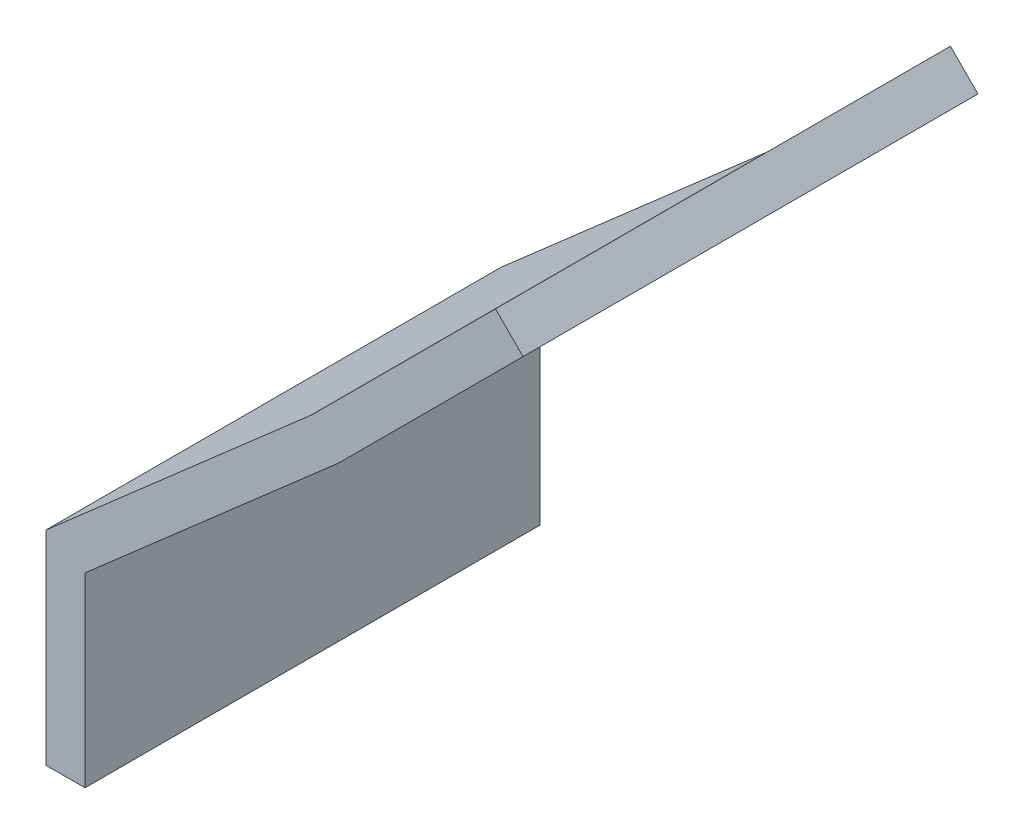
ISO-10303-21;
HEADER;
FILE_DESCRIPTION(('STEP AP214'),'2;1');
FILE_NAME('part.step','',(''),(''),'','','');
FILE_SCHEMA(('AUTOMOTIVE_DESIGN { 1 0 10303 214 1 1 1 1 }'));
ENDSEC;
DATA;
#1=APPLICATION_CONTEXT('core data for automotive mechanical design processes');
#2=APPLICATION_PROTOCOL_DEFINITION('international standard','automotive_design',2000,#1);
#3=PRODUCT_CONTEXT('',#1,'mechanical');
#4=PRODUCT('Part','Part','',(#3));
#5=PRODUCT_RELATED_PRODUCT_CATEGORY('part','',(#4));
#6=PRODUCT_DEFINITION_FORMATION('','',#4);
#7=PRODUCT_DEFINITION_CONTEXT('part definition',#1,'design');
#8=PRODUCT_DEFINITION('design','',#6,#7);
#9=PRODUCT_DEFINITION_SHAPE('','',#8);
#10=(LENGTH_UNIT() NAMED_UNIT(*) SI_UNIT(.MILLI.,.METRE.));
#11=(NAMED_UNIT(*) PLANE_ANGLE_UNIT() SI_UNIT($,.RADIAN.));
#12=(NAMED_UNIT(*) SI_UNIT($,.STERADIAN.) SOLID_ANGLE_UNIT());
#13=UNCERTAINTY_MEASURE_WITH_UNIT(LENGTH_MEASURE(1.E-05),#10,'distance_accuracy_value','');
#14=(GEOMETRIC_REPRESENTATION_CONTEXT(3) GLOBAL_UNCERTAINTY_ASSIGNED_CONTEXT((#13)) GLOBAL_UNIT_ASSIGNED_CONTEXT((#10,
#11,#12)) REPRESENTATION_CONTEXT('',''));
#15=CARTESIAN_POINT('',(0.,0.,0.));
#16=DIRECTION('',(0.,0.,1.));
#17=DIRECTION('',(1.,0.,0.));
#18=AXIS2_PLACEMENT_3D('',#15,#16,#17);
#19=CARTESIAN_POINT('',(-43.,-35.,-10.));
#20=DIRECTION('',(-1.,0.,0.));
#21=DIRECTION('',(0.,0.,1.));
#22=AXIS2_PLACEMENT_3D('',#19,#20,#21);
#23=PLANE('',#22);
#24=DIRECTION('',(0.,0.,1.));
#25=VECTOR('',#24,1.);
#26=CARTESIAN_POINT('',(-43.,-65.,-10.));
#27=LINE('',#26,#25);
#28=CARTESIAN_POINT('',(-43.,-65.,-10.));
#29=VERTEX_POINT('',#28);
#30=CARTESIAN_POINT('',(-43.,-65.,60.));
#31=VERTEX_POINT('',#30);
#32=EDGE_CURVE('E115',#29,#31,#27,.T.);
#33=ORIENTED_EDGE('',*,*,#32,.T.);
#34=DIRECTION('',(0.,1.,0.));
#35=VECTOR('',#34,1.);
#36=CARTESIAN_POINT('',(-43.,-35.,60.));
#37=LINE('',#36,#35);
#38=CARTESIAN_POINT('',(-43.,-33.6386953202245,60.));
#39=VERTEX_POINT('',#38);
#40=EDGE_CURVE('E118',#39,#31,#37,.F.);
#41=ORIENTED_EDGE('',*,*,#40,.F.);
#42=DIRECTION('',(0.,0.,1.));
#43=VECTOR('',#42,1.);
#44=CARTESIAN_POINT('',(-43.,-33.6386953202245,-10.));
#45=LINE('',#44,#43);
#46=CARTESIAN_POINT('',(-43.,-33.6386953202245,-10.));
#47=VERTEX_POINT('',#46);
#48=EDGE_CURVE('E170',#47,#39,#45,.T.);
#49=ORIENTED_EDGE('',*,*,#48,.F.);
#50=DIRECTION('',(0.,1.,0.));
#51=VECTOR('',#50,1.);
#52=CARTESIAN_POINT('',(-43.,-35.,-10.));
#53=LINE('',#52,#51);
#54=EDGE_CURVE('E120',#47,#29,#53,.F.);
#55=ORIENTED_EDGE('',*,*,#54,.T.);
#56=EDGE_LOOP('',(#33,#41,#49,#55));
#57=FACE_BOUND('',#56,.T.);
#58=ADVANCED_FACE('F37',(#57),#23,.T.);
#59=CARTESIAN_POINT('',(-1.97551382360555,2.25773008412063,-10.));
#60=DIRECTION('',(-0.658504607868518,0.752576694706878,0.));
#61=DIRECTION('',(-0.752576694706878,-0.658504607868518,0.));
#62=AXIS2_PLACEMENT_3D('',#59,#60,#61);
#63=PLANE('',#62);
#64=DIRECTION('',(-0.752576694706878,-0.658504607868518,0.));
#65=VECTOR('',#64,1.);
#66=CARTESIAN_POINT('',(-1.97551382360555,2.25773008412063,60.));
#67=LINE('',#66,#65);
#68=CARTESIAN_POINT('',(-2.5518496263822,1.75343625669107,60.));
#69=VERTEX_POINT('',#68);
#70=EDGE_CURVE('E134',#69,#39,#67,.T.);
#71=ORIENTED_EDGE('',*,*,#70,.F.);
#72=DIRECTION('',(0.,0.,1.));
#73=VECTOR('',#72,1.);
#74=CARTESIAN_POINT('',(-2.5518496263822,1.75343625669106,-10.));
#75=LINE('',#74,#73);
#76=CARTESIAN_POINT('',(-2.5518496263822,1.75343625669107,-10.));
#77=VERTEX_POINT('',#76);
#78=EDGE_CURVE('E58',#69,#77,#75,.F.);
#79=ORIENTED_EDGE('',*,*,#78,.T.);
#80=DIRECTION('',(-0.752576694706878,-0.658504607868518,0.));
#81=VECTOR('',#80,1.);
#82=CARTESIAN_POINT('',(-1.97551382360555,2.25773008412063,-10.));
#83=LINE('',#82,#81);
#84=EDGE_CURVE('E125',#77,#47,#83,.T.);
#85=ORIENTED_EDGE('',*,*,#84,.T.);
#86=ORIENTED_EDGE('',*,*,#48,.T.);
#87=EDGE_LOOP('',(#71,#79,#85,#86));
#88=FACE_BOUND('',#87,.T.);
#89=ADVANCED_FACE('F196',(#88),#63,.T.);
#90=CARTESIAN_POINT('',(-2.12132034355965,2.12132034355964,-10.));
#91=DIRECTION('',(-0.707106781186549,0.707106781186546,0.));
#92=DIRECTION('',(-0.707106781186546,-0.707106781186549,0.));
#93=AXIS2_PLACEMENT_3D('',#90,#91,#92);
#94=PLANE('',#93);
#95=DIRECTION('',(-0.707106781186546,-0.707106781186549,0.));
#96=VECTOR('',#95,1.);
#97=CARTESIAN_POINT('',(-2.12132034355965,2.12132034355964,-10.));
#98=LINE('',#97,#96);
#99=CARTESIAN_POINT('',(26.1629509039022,30.4055915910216,-10.));
#100=VERTEX_POINT('',#99);
#101=CARTESIAN_POINT('',(-1.57980616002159,2.6628345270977,-10.));
#102=VERTEX_POINT('',#101);
#103=EDGE_CURVE('E167',#100,#102,#98,.T.);
#104=ORIENTED_EDGE('',*,*,#103,.T.);
#105=DIRECTION('',(0.,0.,1.));
#106=VECTOR('',#105,1.);
#107=CARTESIAN_POINT('',(-1.57980616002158,2.6628345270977,60.));
#108=LINE('',#107,#106);
#109=CARTESIAN_POINT('',(-1.57980616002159,2.6628345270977,60.));
#110=VERTEX_POINT('',#109);
#111=EDGE_CURVE('E189',#102,#110,#108,.T.);
#112=ORIENTED_EDGE('',*,*,#111,.T.);
#113=DIRECTION('',(-0.707106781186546,-0.707106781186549,0.));
#114=VECTOR('',#113,1.);
#115=CARTESIAN_POINT('',(-2.12132034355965,2.12132034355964,60.));
#116=LINE('',#115,#114);
#117=CARTESIAN_POINT('',(26.1629509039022,30.4055915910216,60.));
#118=VERTEX_POINT('',#117);
#119=EDGE_CURVE('E151',#118,#110,#116,.T.);
#120=ORIENTED_EDGE('',*,*,#119,.F.);
#121=DIRECTION('',(0.,0.,1.));
#122=VECTOR('',#121,1.);
#123=CARTESIAN_POINT('',(26.1629509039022,30.4055915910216,-10.));
#124=LINE('',#123,#122);
#125=EDGE_CURVE('E173',#100,#118,#124,.T.);
#126=ORIENTED_EDGE('',*,*,#125,.F.);
#127=EDGE_LOOP('',(#104,#112,#120,#126));
#128=FACE_BOUND('',#127,.T.);
#129=ADVANCED_FACE('F198',(#128),#94,.T.);
#130=CARTESIAN_POINT('',(26.1629509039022,30.4055915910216,-10.));
#131=DIRECTION('',(-0.707106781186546,-0.707106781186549,0.));
#132=DIRECTION('',(0.707106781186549,-0.707106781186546,0.));
#133=AXIS2_PLACEMENT_3D('',#130,#131,#132);
#134=PLANE('',#133);
#135=ORIENTED_EDGE('',*,*,#125,.T.);
#136=DIRECTION('',(0.707106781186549,-0.707106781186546,0.));
#137=VECTOR('',#136,1.);
#138=CARTESIAN_POINT('',(26.1629509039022,30.4055915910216,60.));
#139=LINE('',#138,#137);
#140=CARTESIAN_POINT('',(30.4055915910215,26.1629509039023,60.));
#141=VERTEX_POINT('',#140);
#142=EDGE_CURVE('E148',#118,#141,#139,.T.);
#143=ORIENTED_EDGE('',*,*,#142,.T.);
#144=DIRECTION('',(0.,0.,1.));
#145=VECTOR('',#144,1.);
#146=CARTESIAN_POINT('',(30.4055915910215,26.1629509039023,-10.));
#147=LINE('',#146,#145);
#148=CARTESIAN_POINT('',(30.4055915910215,26.1629509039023,-10.));
#149=VERTEX_POINT('',#148);
#150=EDGE_CURVE('E175',#149,#141,#147,.T.);
#151=ORIENTED_EDGE('',*,*,#150,.F.);
#152=DIRECTION('',(0.707106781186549,-0.707106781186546,0.));
#153=VECTOR('',#152,1.);
#154=CARTESIAN_POINT('',(26.1629509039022,30.4055915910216,-10.));
#155=LINE('',#154,#153);
#156=EDGE_CURVE('E165',#100,#149,#155,.T.);
#157=ORIENTED_EDGE('',*,*,#156,.F.);
#158=EDGE_LOOP('',(#135,#143,#151,#157));
#159=FACE_BOUND('',#158,.T.);
#160=ADVANCED_FACE('F205',(#159),#134,.F.);
#161=CARTESIAN_POINT('',(2.12132034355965,-2.12132034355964,-10.));
#162=DIRECTION('',(-0.707106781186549,0.707106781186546,0.));
#163=DIRECTION('',(-0.707106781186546,-0.707106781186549,0.));
#164=AXIS2_PLACEMENT_3D('',#161,#162,#163);
#165=PLANE('',#164);
#166=DIRECTION('',(-0.707106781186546,-0.707106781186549,0.));
#167=VECTOR('',#166,1.);
#168=CARTESIAN_POINT('',(2.12132034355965,-2.12132034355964,60.));
#169=LINE('',#168,#167);
#170=CARTESIAN_POINT('',(2.52156995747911,-1.72107072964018,60.));
#171=VERTEX_POINT('',#170);
#172=EDGE_CURVE('E145',#141,#171,#169,.T.);
#173=ORIENTED_EDGE('',*,*,#172,.T.);
#174=DIRECTION('',(0.,0.,1.));
#175=VECTOR('',#174,1.);
#176=CARTESIAN_POINT('',(2.52156995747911,-1.72107072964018,-10.));
#177=LINE('',#176,#175);
#178=CARTESIAN_POINT('',(2.52156995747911,-1.72107072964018,-10.));
#179=VERTEX_POINT('',#178);
#180=EDGE_CURVE('E185',#171,#179,#177,.F.);
#181=ORIENTED_EDGE('',*,*,#180,.T.);
#182=DIRECTION('',(-0.707106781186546,-0.707106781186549,0.));
#183=VECTOR('',#182,1.);
#184=CARTESIAN_POINT('',(2.12132034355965,-2.12132034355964,-10.));
#185=LINE('',#184,#183);
#186=EDGE_CURVE('E162',#149,#179,#185,.T.);
#187=ORIENTED_EDGE('',*,*,#186,.F.);
#188=ORIENTED_EDGE('',*,*,#150,.T.);
#189=EDGE_LOOP('',(#173,#181,#187,#188));
#190=FACE_BOUND('',#189,.T.);
#191=ADVANCED_FACE('F208',(#190),#165,.F.);
#192=CARTESIAN_POINT('',(1.97551382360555,-2.25773008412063,-10.));
#193=DIRECTION('',(-0.658504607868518,0.752576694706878,0.));
#194=DIRECTION('',(-0.752576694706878,-0.658504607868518,0.));
#195=AXIS2_PLACEMENT_3D('',#192,#193,#194);
#196=PLANE('',#195);
#197=DIRECTION('',(-0.752576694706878,-0.658504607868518,0.));
#198=VECTOR('',#197,1.);
#199=CARTESIAN_POINT('',(1.97551382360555,-2.25773008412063,-10.));
#200=LINE('',#199,#198);
#201=CARTESIAN_POINT('',(1.54952649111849,-2.63046900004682,-10.));
#202=VERTEX_POINT('',#201);
#203=CARTESIAN_POINT('',(-37.,-36.3613046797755,-10.));
#204=VERTEX_POINT('',#203);
#205=EDGE_CURVE('E160',#202,#204,#200,.T.);
#206=ORIENTED_EDGE('',*,*,#205,.F.);
#207=DIRECTION('',(0.,0.,1.));
#208=VECTOR('',#207,1.);
#209=CARTESIAN_POINT('',(1.54952649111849,-2.63046900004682,-10.));
#210=LINE('',#209,#208);
#211=CARTESIAN_POINT('',(1.54952649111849,-2.63046900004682,60.));
#212=VERTEX_POINT('',#211);
#213=EDGE_CURVE('E172',#202,#212,#210,.T.);
#214=ORIENTED_EDGE('',*,*,#213,.T.);
#215=DIRECTION('',(-0.752576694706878,-0.658504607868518,0.));
#216=VECTOR('',#215,1.);
#217=CARTESIAN_POINT('',(1.97551382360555,-2.25773008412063,60.));
#218=LINE('',#217,#216);
#219=CARTESIAN_POINT('',(-37.,-36.3613046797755,60.));
#220=VERTEX_POINT('',#219);
#221=EDGE_CURVE('E141',#212,#220,#218,.T.);
#222=ORIENTED_EDGE('',*,*,#221,.T.);
#223=DIRECTION('',(0.,0.,1.));
#224=VECTOR('',#223,1.);
#225=CARTESIAN_POINT('',(-37.,-36.3613046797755,-10.));
#226=LINE('',#225,#224);
#227=EDGE_CURVE('E177',#204,#220,#226,.T.);
#228=ORIENTED_EDGE('',*,*,#227,.F.);
#229=EDGE_LOOP('',(#206,#214,#222,#228));
#230=FACE_BOUND('',#229,.T.);
#231=ADVANCED_FACE('F216',(#230),#196,.F.);
#232=CARTESIAN_POINT('',(-37.,-35.,-10.));
#233=DIRECTION('',(-1.,0.,0.));
#234=DIRECTION('',(0.,0.,1.));
#235=AXIS2_PLACEMENT_3D('',#232,#233,#234);
#236=PLANE('',#235);
#237=ORIENTED_EDGE('',*,*,#227,.T.);
#238=DIRECTION('',(0.,1.,0.));
#239=VECTOR('',#238,1.);
#240=CARTESIAN_POINT('',(-37.,-35.,60.));
#241=LINE('',#240,#239);
#242=CARTESIAN_POINT('',(-37.,-65.,60.));
#243=VERTEX_POINT('',#242);
#244=EDGE_CURVE('E139',#220,#243,#241,.F.);
#245=ORIENTED_EDGE('',*,*,#244,.T.);
#246=DIRECTION('',(0.,0.,1.));
#247=VECTOR('',#246,1.);
#248=CARTESIAN_POINT('',(-37.,-65.,-10.));
#249=LINE('',#248,#247);
#250=CARTESIAN_POINT('',(-37.,-65.,-10.));
#251=VERTEX_POINT('',#250);
#252=EDGE_CURVE('E124',#251,#243,#249,.T.);
#253=ORIENTED_EDGE('',*,*,#252,.F.);
#254=DIRECTION('',(0.,1.,0.));
#255=VECTOR('',#254,1.);
#256=CARTESIAN_POINT('',(-37.,-35.,-10.));
#257=LINE('',#256,#255);
#258=EDGE_CURVE('E158',#204,#251,#257,.F.);
#259=ORIENTED_EDGE('',*,*,#258,.F.);
#260=EDGE_LOOP('',(#237,#245,#253,#259));
#261=FACE_BOUND('',#260,.T.);
#262=ADVANCED_FACE('F219',(#261),#236,.F.);
#263=CARTESIAN_POINT('',(-37.,-65.,-10.));
#264=DIRECTION('',(0.,1.,0.));
#265=DIRECTION('',(0.,0.,1.));
#266=AXIS2_PLACEMENT_3D('',#263,#264,#265);
#267=PLANE('',#266);
#268=ORIENTED_EDGE('',*,*,#252,.T.);
#269=DIRECTION('',(-1.,0.,0.));
#270=VECTOR('',#269,1.);
#271=CARTESIAN_POINT('',(-37.,-65.,60.));
#272=LINE('',#271,#270);
#273=EDGE_CURVE('E132',#243,#31,#272,.T.);
#274=ORIENTED_EDGE('',*,*,#273,.T.);
#275=ORIENTED_EDGE('',*,*,#32,.F.);
#276=DIRECTION('',(-1.,0.,0.));
#277=VECTOR('',#276,1.);
#278=CARTESIAN_POINT('',(-37.,-65.,-10.));
#279=LINE('',#278,#277);
#280=EDGE_CURVE('E156',#251,#29,#279,.T.);
#281=ORIENTED_EDGE('',*,*,#280,.F.);
#282=EDGE_LOOP('',(#268,#274,#275,#281));
#283=FACE_BOUND('',#282,.T.);
#284=ADVANCED_FACE('F137',(#283),#267,.F.);
#285=CARTESIAN_POINT('',(0.,0.,-10.));
#286=DIRECTION('',(0.,0.,1.));
#287=DIRECTION('',(1.,0.,0.));
#288=AXIS2_PLACEMENT_3D('',#285,#286,#287);
#289=PLANE('',#288);
#290=ORIENTED_EDGE('',*,*,#186,.T.);
#291=CARTESIAN_POINT('',(-11.6205656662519,12.4210648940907,-10.));
#292=DIRECTION('',(0.,0.,1.));
#293=DIRECTION('',(1.,0.,0.));
#294=AXIS2_PLACEMENT_3D('',#291,#292,#293);
#295=CIRCLE('',#294,20.);
#296=EDGE_CURVE('E187',#179,#202,#295,.F.);
#297=ORIENTED_EDGE('',*,*,#296,.T.);
#298=ORIENTED_EDGE('',*,*,#205,.T.);
#299=ORIENTED_EDGE('',*,*,#258,.T.);
#300=ORIENTED_EDGE('',*,*,#280,.T.);
#301=ORIENTED_EDGE('',*,*,#54,.F.);
#302=ORIENTED_EDGE('',*,*,#84,.F.);
#303=CARTESIAN_POINT('',(-15.7219417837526,16.8049701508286,-10.));
#304=DIRECTION('',(0.,0.,1.));
#305=DIRECTION('',(1.,0.,0.));
#306=AXIS2_PLACEMENT_3D('',#303,#304,#305);
#307=CIRCLE('',#306,20.);
#308=EDGE_CURVE('E11',#77,#102,#307,.T.);
#309=ORIENTED_EDGE('',*,*,#308,.T.);
#310=ORIENTED_EDGE('',*,*,#103,.F.);
#311=ORIENTED_EDGE('',*,*,#156,.T.);
#312=EDGE_LOOP('',(#290,#297,#298,#299,#300,#301,#302,#309,#310,#311));
#313=FACE_BOUND('',#312,.T.);
#314=ADVANCED_FACE('F200',(#313),#289,.F.);
#315=CARTESIAN_POINT('',(0.,0.,60.));
#316=DIRECTION('',(0.,0.,1.));
#317=DIRECTION('',(1.,0.,0.));
#318=AXIS2_PLACEMENT_3D('',#315,#316,#317);
#319=PLANE('',#318);
#320=ORIENTED_EDGE('',*,*,#221,.F.);
#321=CARTESIAN_POINT('',(-11.6205656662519,12.4210648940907,60.));
#322=DIRECTION('',(0.,0.,1.));
#323=DIRECTION('',(1.,0.,0.));
#324=AXIS2_PLACEMENT_3D('',#321,#322,#323);
#325=CIRCLE('',#324,20.);
#326=EDGE_CURVE('E183',#212,#171,#325,.T.);
#327=ORIENTED_EDGE('',*,*,#326,.T.);
#328=ORIENTED_EDGE('',*,*,#172,.F.);
#329=ORIENTED_EDGE('',*,*,#142,.F.);
#330=ORIENTED_EDGE('',*,*,#119,.T.);
#331=CARTESIAN_POINT('',(-15.7219417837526,16.8049701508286,60.));
#332=DIRECTION('',(0.,0.,1.));
#333=DIRECTION('',(1.,0.,0.));
#334=AXIS2_PLACEMENT_3D('',#331,#332,#333);
#335=CIRCLE('',#334,20.);
#336=EDGE_CURVE('E45',#110,#69,#335,.F.);
#337=ORIENTED_EDGE('',*,*,#336,.T.);
#338=ORIENTED_EDGE('',*,*,#70,.T.);
#339=ORIENTED_EDGE('',*,*,#40,.T.);
#340=ORIENTED_EDGE('',*,*,#273,.F.);
#341=ORIENTED_EDGE('',*,*,#244,.F.);
#342=EDGE_LOOP('',(#320,#327,#328,#329,#330,#337,#338,#339,#340,#341));
#343=FACE_BOUND('',#342,.T.);
#344=ADVANCED_FACE('F130',(#343),#319,.T.);
#345=CARTESIAN_POINT('',(-11.6205656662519,12.4210648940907,-10.));
#346=DIRECTION('',(0.,0.,1.));
#347=DIRECTION('',(1.,0.,0.));
#348=AXIS2_PLACEMENT_3D('',#345,#346,#347);
#349=CYLINDRICAL_SURFACE('',#348,20.);
#350=ORIENTED_EDGE('',*,*,#296,.F.);
#351=ORIENTED_EDGE('',*,*,#180,.F.);
#352=ORIENTED_EDGE('',*,*,#326,.F.);
#353=ORIENTED_EDGE('',*,*,#213,.F.);
#354=EDGE_LOOP('',(#350,#351,#352,#353));
#355=FACE_BOUND('',#354,.T.);
#356=ADVANCED_FACE('F211',(#355),#349,.T.);
#357=CARTESIAN_POINT('',(-15.7219417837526,16.8049701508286,-10.));
#358=DIRECTION('',(0.,0.,-1.));
#359=DIRECTION('',(-1.,0.,0.));
#360=AXIS2_PLACEMENT_3D('',#357,#358,#359);
#361=CYLINDRICAL_SURFACE('',#360,20.);
#362=ORIENTED_EDGE('',*,*,#308,.F.);
#363=ORIENTED_EDGE('',*,*,#78,.F.);
#364=ORIENTED_EDGE('',*,*,#336,.F.);
#365=ORIENTED_EDGE('',*,*,#111,.F.);
#366=EDGE_LOOP('',(#362,#363,#364,#365));
#367=FACE_BOUND('',#366,.T.);
#368=ADVANCED_FACE('F39',(#367),#361,.F.);
#369=CLOSED_SHELL('',(#58,#89,#129,#160,#191,#231,#262,#284,#314,#344,#356,#368));
#370=MANIFOLD_SOLID_BREP('B2',#369);
#371=ADVANCED_BREP_SHAPE_REPRESENTATION('',(#18,#370),#14);
#372=SHAPE_DEFINITION_REPRESENTATION(#9,#371);
ENDSEC;
END-ISO-10303-21;
